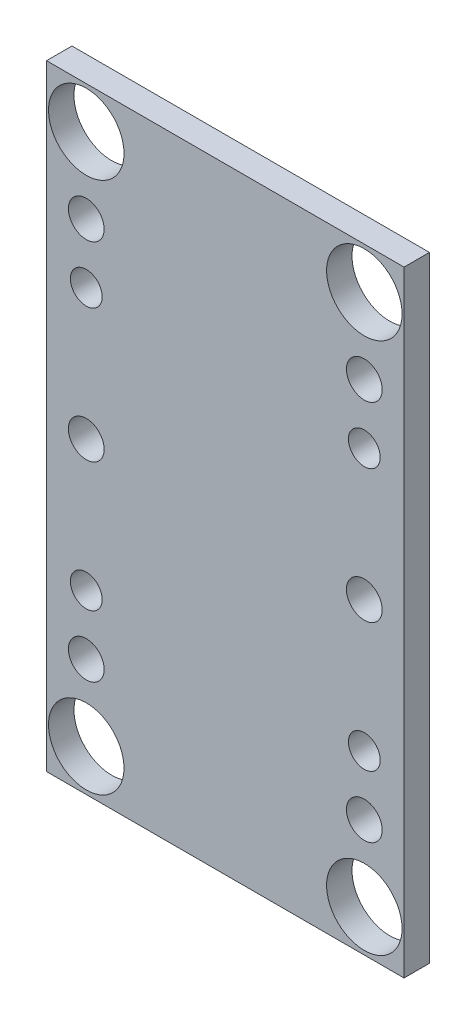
ISO-10303-21;
HEADER;
FILE_DESCRIPTION(('STEP AP214'),'2;1');
FILE_NAME('part.step','',(''),(''),'','','');
FILE_SCHEMA(('AUTOMOTIVE_DESIGN { 1 0 10303 214 1 1 1 1 }'));
ENDSEC;
DATA;
#1=APPLICATION_CONTEXT('core data for automotive mechanical design processes');
#2=APPLICATION_PROTOCOL_DEFINITION('international standard','automotive_design',2000,#1);
#3=PRODUCT_CONTEXT('',#1,'mechanical');
#4=PRODUCT('Part','Part','',(#3));
#5=PRODUCT_RELATED_PRODUCT_CATEGORY('part','',(#4));
#6=PRODUCT_DEFINITION_FORMATION('','',#4);
#7=PRODUCT_DEFINITION_CONTEXT('part definition',#1,'design');
#8=PRODUCT_DEFINITION('design','',#6,#7);
#9=PRODUCT_DEFINITION_SHAPE('','',#8);
#10=(LENGTH_UNIT() NAMED_UNIT(*) SI_UNIT(.MILLI.,.METRE.));
#11=(NAMED_UNIT(*) PLANE_ANGLE_UNIT() SI_UNIT($,.RADIAN.));
#12=(NAMED_UNIT(*) SI_UNIT($,.STERADIAN.) SOLID_ANGLE_UNIT());
#13=UNCERTAINTY_MEASURE_WITH_UNIT(LENGTH_MEASURE(1.E-05),#10,'distance_accuracy_value','');
#14=(GEOMETRIC_REPRESENTATION_CONTEXT(3) GLOBAL_UNCERTAINTY_ASSIGNED_CONTEXT((#13)) GLOBAL_UNIT_ASSIGNED_CONTEXT((#10,
#11,#12)) REPRESENTATION_CONTEXT('',''));
#15=CARTESIAN_POINT('',(0.,0.,0.));
#16=DIRECTION('',(0.,0.,1.));
#17=DIRECTION('',(1.,0.,0.));
#18=AXIS2_PLACEMENT_3D('',#15,#16,#17);
#19=CARTESIAN_POINT('',(-45.,-78.,6.4));
#20=DIRECTION('',(0.,0.,1.));
#21=DIRECTION('',(1.,0.,0.));
#22=AXIS2_PLACEMENT_3D('',#19,#20,#21);
#23=PLANE('',#22);
#24=CARTESIAN_POINT('',(-35.,-67.,6.4));
#25=DIRECTION('',(0.,0.,1.));
#26=DIRECTION('',(1.,0.,0.));
#27=AXIS2_PLACEMENT_3D('',#24,#25,#26);
#28=CIRCLE('',#27,9.5);
#29=CARTESIAN_POINT('',(-25.5,-67.,6.4));
#30=VERTEX_POINT('',#29);
#31=EDGE_CURVE('E122',#30,#30,#28,.T.);
#32=ORIENTED_EDGE('',*,*,#31,.F.);
#33=EDGE_LOOP('',(#32));
#34=FACE_BOUND('',#33,.T.);
#35=CARTESIAN_POINT('',(-35.,0.,6.4));
#36=DIRECTION('',(0.,0.,1.));
#37=DIRECTION('',(1.,0.,0.));
#38=AXIS2_PLACEMENT_3D('',#35,#36,#37);
#39=CIRCLE('',#38,4.5);
#40=CARTESIAN_POINT('',(-30.5,0.,6.4));
#41=VERTEX_POINT('',#40);
#42=EDGE_CURVE('E134',#41,#41,#39,.T.);
#43=ORIENTED_EDGE('',*,*,#42,.F.);
#44=EDGE_LOOP('',(#43));
#45=FACE_BOUND('',#44,.T.);
#46=CARTESIAN_POINT('',(-35.,33.,6.4));
#47=DIRECTION('',(0.,0.,1.));
#48=DIRECTION('',(1.,0.,0.));
#49=AXIS2_PLACEMENT_3D('',#46,#47,#48);
#50=CIRCLE('',#49,4.00375);
#51=CARTESIAN_POINT('',(-30.99625,33.,6.4));
#52=VERTEX_POINT('',#51);
#53=EDGE_CURVE('E146',#52,#52,#50,.T.);
#54=ORIENTED_EDGE('',*,*,#53,.F.);
#55=EDGE_LOOP('',(#54));
#56=FACE_BOUND('',#55,.T.);
#57=CARTESIAN_POINT('',(35.,-67.,6.4));
#58=DIRECTION('',(0.,0.,1.));
#59=DIRECTION('',(1.,0.,0.));
#60=AXIS2_PLACEMENT_3D('',#57,#58,#59);
#61=CIRCLE('',#60,9.5);
#62=CARTESIAN_POINT('',(44.5,-67.,6.4));
#63=VERTEX_POINT('',#62);
#64=EDGE_CURVE('E158',#63,#63,#61,.T.);
#65=ORIENTED_EDGE('',*,*,#64,.F.);
#66=EDGE_LOOP('',(#65));
#67=FACE_BOUND('',#66,.T.);
#68=CARTESIAN_POINT('',(35.,-48.,6.4));
#69=DIRECTION('',(0.,0.,1.));
#70=DIRECTION('',(1.,0.,0.));
#71=AXIS2_PLACEMENT_3D('',#68,#69,#70);
#72=CIRCLE('',#71,4.5);
#73=CARTESIAN_POINT('',(39.5,-48.,6.4));
#74=VERTEX_POINT('',#73);
#75=EDGE_CURVE('E170',#74,#74,#72,.T.);
#76=ORIENTED_EDGE('',*,*,#75,.F.);
#77=EDGE_LOOP('',(#76));
#78=FACE_BOUND('',#77,.T.);
#79=CARTESIAN_POINT('',(35.,48.,6.4));
#80=DIRECTION('',(0.,0.,1.));
#81=DIRECTION('',(1.,0.,0.));
#82=AXIS2_PLACEMENT_3D('',#79,#80,#81);
#83=CIRCLE('',#82,4.5);
#84=CARTESIAN_POINT('',(39.5,48.,6.4));
#85=VERTEX_POINT('',#84);
#86=EDGE_CURVE('E182',#85,#85,#83,.T.);
#87=ORIENTED_EDGE('',*,*,#86,.F.);
#88=EDGE_LOOP('',(#87));
#89=FACE_BOUND('',#88,.T.);
#90=CARTESIAN_POINT('',(35.,33.,6.4));
#91=DIRECTION('',(0.,0.,1.));
#92=DIRECTION('',(1.,0.,0.));
#93=AXIS2_PLACEMENT_3D('',#90,#91,#92);
#94=CIRCLE('',#93,4.00375);
#95=CARTESIAN_POINT('',(39.00375,33.,6.4));
#96=VERTEX_POINT('',#95);
#97=EDGE_CURVE('E91',#96,#96,#94,.T.);
#98=ORIENTED_EDGE('',*,*,#97,.F.);
#99=EDGE_LOOP('',(#98));
#100=FACE_BOUND('',#99,.T.);
#101=CARTESIAN_POINT('',(35.,-33.,6.4));
#102=DIRECTION('',(0.,0.,1.));
#103=DIRECTION('',(1.,0.,0.));
#104=AXIS2_PLACEMENT_3D('',#101,#102,#103);
#105=CIRCLE('',#104,4.00375);
#106=CARTESIAN_POINT('',(39.00375,-33.,6.4));
#107=VERTEX_POINT('',#106);
#108=EDGE_CURVE('E188',#107,#107,#105,.T.);
#109=ORIENTED_EDGE('',*,*,#108,.F.);
#110=EDGE_LOOP('',(#109));
#111=FACE_BOUND('',#110,.T.);
#112=CARTESIAN_POINT('',(35.,0.,6.4));
#113=DIRECTION('',(0.,0.,1.));
#114=DIRECTION('',(1.,0.,0.));
#115=AXIS2_PLACEMENT_3D('',#112,#113,#114);
#116=CIRCLE('',#115,4.5);
#117=CARTESIAN_POINT('',(39.5,0.,6.4));
#118=VERTEX_POINT('',#117);
#119=EDGE_CURVE('E176',#118,#118,#116,.T.);
#120=ORIENTED_EDGE('',*,*,#119,.F.);
#121=EDGE_LOOP('',(#120));
#122=FACE_BOUND('',#121,.T.);
#123=CARTESIAN_POINT('',(35.,67.,6.4));
#124=DIRECTION('',(0.,0.,1.));
#125=DIRECTION('',(1.,0.,0.));
#126=AXIS2_PLACEMENT_3D('',#123,#124,#125);
#127=CIRCLE('',#126,9.5);
#128=CARTESIAN_POINT('',(44.5,67.,6.4));
#129=VERTEX_POINT('',#128);
#130=EDGE_CURVE('E164',#129,#129,#127,.T.);
#131=ORIENTED_EDGE('',*,*,#130,.F.);
#132=EDGE_LOOP('',(#131));
#133=FACE_BOUND('',#132,.T.);
#134=CARTESIAN_POINT('',(-35.,-33.,6.4));
#135=DIRECTION('',(0.,0.,1.));
#136=DIRECTION('',(1.,0.,0.));
#137=AXIS2_PLACEMENT_3D('',#134,#135,#136);
#138=CIRCLE('',#137,4.00375);
#139=CARTESIAN_POINT('',(-30.99625,-33.,6.4));
#140=VERTEX_POINT('',#139);
#141=EDGE_CURVE('E152',#140,#140,#138,.T.);
#142=ORIENTED_EDGE('',*,*,#141,.F.);
#143=EDGE_LOOP('',(#142));
#144=FACE_BOUND('',#143,.T.);
#145=CARTESIAN_POINT('',(-35.,-48.,6.4));
#146=DIRECTION('',(0.,0.,1.));
#147=DIRECTION('',(1.,0.,0.));
#148=AXIS2_PLACEMENT_3D('',#145,#146,#147);
#149=CIRCLE('',#148,4.5);
#150=CARTESIAN_POINT('',(-30.5,-48.,6.4));
#151=VERTEX_POINT('',#150);
#152=EDGE_CURVE('E140',#151,#151,#149,.T.);
#153=ORIENTED_EDGE('',*,*,#152,.F.);
#154=EDGE_LOOP('',(#153));
#155=FACE_BOUND('',#154,.T.);
#156=CARTESIAN_POINT('',(-35.,48.,6.4));
#157=DIRECTION('',(0.,0.,1.));
#158=DIRECTION('',(1.,0.,0.));
#159=AXIS2_PLACEMENT_3D('',#156,#157,#158);
#160=CIRCLE('',#159,4.5);
#161=CARTESIAN_POINT('',(-30.5,48.,6.4));
#162=VERTEX_POINT('',#161);
#163=EDGE_CURVE('E128',#162,#162,#160,.T.);
#164=ORIENTED_EDGE('',*,*,#163,.F.);
#165=EDGE_LOOP('',(#164));
#166=FACE_BOUND('',#165,.T.);
#167=CARTESIAN_POINT('',(-35.,67.,6.4));
#168=DIRECTION('',(0.,0.,1.));
#169=DIRECTION('',(1.,0.,0.));
#170=AXIS2_PLACEMENT_3D('',#167,#168,#169);
#171=CIRCLE('',#170,9.5);
#172=CARTESIAN_POINT('',(-25.5,67.,6.4));
#173=VERTEX_POINT('',#172);
#174=EDGE_CURVE('E116',#173,#173,#171,.T.);
#175=ORIENTED_EDGE('',*,*,#174,.F.);
#176=EDGE_LOOP('',(#175));
#177=FACE_BOUND('',#176,.T.);
#178=DIRECTION('',(0.,-1.,0.));
#179=VECTOR('',#178,1.);
#180=CARTESIAN_POINT('',(-45.,78.,6.4));
#181=LINE('',#180,#179);
#182=CARTESIAN_POINT('',(-45.,77.5,6.4));
#183=VERTEX_POINT('',#182);
#184=CARTESIAN_POINT('',(-45.,-77.5,6.4));
#185=VERTEX_POINT('',#184);
#186=EDGE_CURVE('E87',#183,#185,#181,.T.);
#187=ORIENTED_EDGE('',*,*,#186,.T.);
#188=DIRECTION('',(1.,0.,0.));
#189=VECTOR('',#188,1.);
#190=CARTESIAN_POINT('',(-45.,-77.5,6.4));
#191=LINE('',#190,#189);
#192=CARTESIAN_POINT('',(45.,-77.5,6.4));
#193=VERTEX_POINT('',#192);
#194=EDGE_CURVE('E105',#185,#193,#191,.T.);
#195=ORIENTED_EDGE('',*,*,#194,.T.);
#196=DIRECTION('',(0.,1.,0.));
#197=VECTOR('',#196,1.);
#198=CARTESIAN_POINT('',(45.,-78.,6.4));
#199=LINE('',#198,#197);
#200=CARTESIAN_POINT('',(45.,77.5,6.4));
#201=VERTEX_POINT('',#200);
#202=EDGE_CURVE('E100',#193,#201,#199,.T.);
#203=ORIENTED_EDGE('',*,*,#202,.T.);
#204=DIRECTION('',(-1.,0.,0.));
#205=VECTOR('',#204,1.);
#206=CARTESIAN_POINT('',(-45.,77.5,6.4));
#207=LINE('',#206,#205);
#208=EDGE_CURVE('E48',#201,#183,#207,.T.);
#209=ORIENTED_EDGE('',*,*,#208,.T.);
#210=EDGE_LOOP('',(#187,#195,#203,#209));
#211=FACE_BOUND('',#210,.T.);
#212=ADVANCED_FACE('F33',(#34,#45,#56,#67,#78,#89,#100,#111,#122,#133,#144,#155,#166,#177,#211),
#23,.T.);
#213=CARTESIAN_POINT('',(-45.,-78.,0.));
#214=DIRECTION('',(0.,0.,1.));
#215=DIRECTION('',(1.,0.,0.));
#216=AXIS2_PLACEMENT_3D('',#213,#214,#215);
#217=PLANE('',#216);
#218=CARTESIAN_POINT('',(-35.,-67.,0.));
#219=DIRECTION('',(0.,0.,1.));
#220=DIRECTION('',(1.,0.,0.));
#221=AXIS2_PLACEMENT_3D('',#218,#219,#220);
#222=CIRCLE('',#221,9.5);
#223=CARTESIAN_POINT('',(-25.5,-67.,0.));
#224=VERTEX_POINT('',#223);
#225=EDGE_CURVE('E119',#224,#224,#222,.T.);
#226=ORIENTED_EDGE('',*,*,#225,.T.);
#227=EDGE_LOOP('',(#226));
#228=FACE_BOUND('',#227,.T.);
#229=CARTESIAN_POINT('',(-35.,0.,0.));
#230=DIRECTION('',(0.,0.,1.));
#231=DIRECTION('',(1.,0.,0.));
#232=AXIS2_PLACEMENT_3D('',#229,#230,#231);
#233=CIRCLE('',#232,4.5);
#234=CARTESIAN_POINT('',(-30.5,0.,0.));
#235=VERTEX_POINT('',#234);
#236=EDGE_CURVE('E131',#235,#235,#233,.T.);
#237=ORIENTED_EDGE('',*,*,#236,.T.);
#238=EDGE_LOOP('',(#237));
#239=FACE_BOUND('',#238,.T.);
#240=CARTESIAN_POINT('',(-35.,33.,0.));
#241=DIRECTION('',(0.,0.,1.));
#242=DIRECTION('',(1.,0.,0.));
#243=AXIS2_PLACEMENT_3D('',#240,#241,#242);
#244=CIRCLE('',#243,4.00375);
#245=CARTESIAN_POINT('',(-30.99625,33.,0.));
#246=VERTEX_POINT('',#245);
#247=EDGE_CURVE('E143',#246,#246,#244,.T.);
#248=ORIENTED_EDGE('',*,*,#247,.T.);
#249=EDGE_LOOP('',(#248));
#250=FACE_BOUND('',#249,.T.);
#251=CARTESIAN_POINT('',(35.,-67.,0.));
#252=DIRECTION('',(0.,0.,1.));
#253=DIRECTION('',(1.,0.,0.));
#254=AXIS2_PLACEMENT_3D('',#251,#252,#253);
#255=CIRCLE('',#254,9.5);
#256=CARTESIAN_POINT('',(44.5,-67.,0.));
#257=VERTEX_POINT('',#256);
#258=EDGE_CURVE('E155',#257,#257,#255,.T.);
#259=ORIENTED_EDGE('',*,*,#258,.T.);
#260=EDGE_LOOP('',(#259));
#261=FACE_BOUND('',#260,.T.);
#262=CARTESIAN_POINT('',(35.,-48.,0.));
#263=DIRECTION('',(0.,0.,1.));
#264=DIRECTION('',(1.,0.,0.));
#265=AXIS2_PLACEMENT_3D('',#262,#263,#264);
#266=CIRCLE('',#265,4.5);
#267=CARTESIAN_POINT('',(39.5,-48.,0.));
#268=VERTEX_POINT('',#267);
#269=EDGE_CURVE('E167',#268,#268,#266,.T.);
#270=ORIENTED_EDGE('',*,*,#269,.T.);
#271=EDGE_LOOP('',(#270));
#272=FACE_BOUND('',#271,.T.);
#273=CARTESIAN_POINT('',(35.,48.,0.));
#274=DIRECTION('',(0.,0.,1.));
#275=DIRECTION('',(1.,0.,0.));
#276=AXIS2_PLACEMENT_3D('',#273,#274,#275);
#277=CIRCLE('',#276,4.5);
#278=CARTESIAN_POINT('',(39.5,48.,0.));
#279=VERTEX_POINT('',#278);
#280=EDGE_CURVE('E179',#279,#279,#277,.T.);
#281=ORIENTED_EDGE('',*,*,#280,.T.);
#282=EDGE_LOOP('',(#281));
#283=FACE_BOUND('',#282,.T.);
#284=CARTESIAN_POINT('',(35.,33.,0.));
#285=DIRECTION('',(0.,0.,1.));
#286=DIRECTION('',(1.,0.,0.));
#287=AXIS2_PLACEMENT_3D('',#284,#285,#286);
#288=CIRCLE('',#287,4.00375);
#289=CARTESIAN_POINT('',(39.00375,33.,0.));
#290=VERTEX_POINT('',#289);
#291=EDGE_CURVE('E95',#290,#290,#288,.T.);
#292=ORIENTED_EDGE('',*,*,#291,.T.);
#293=EDGE_LOOP('',(#292));
#294=FACE_BOUND('',#293,.T.);
#295=CARTESIAN_POINT('',(35.,-33.,0.));
#296=DIRECTION('',(0.,0.,1.));
#297=DIRECTION('',(1.,0.,0.));
#298=AXIS2_PLACEMENT_3D('',#295,#296,#297);
#299=CIRCLE('',#298,4.00375);
#300=CARTESIAN_POINT('',(39.00375,-33.,0.));
#301=VERTEX_POINT('',#300);
#302=EDGE_CURVE('E185',#301,#301,#299,.T.);
#303=ORIENTED_EDGE('',*,*,#302,.T.);
#304=EDGE_LOOP('',(#303));
#305=FACE_BOUND('',#304,.T.);
#306=CARTESIAN_POINT('',(35.,0.,0.));
#307=DIRECTION('',(0.,0.,1.));
#308=DIRECTION('',(1.,0.,0.));
#309=AXIS2_PLACEMENT_3D('',#306,#307,#308);
#310=CIRCLE('',#309,4.5);
#311=CARTESIAN_POINT('',(39.5,0.,0.));
#312=VERTEX_POINT('',#311);
#313=EDGE_CURVE('E173',#312,#312,#310,.T.);
#314=ORIENTED_EDGE('',*,*,#313,.T.);
#315=EDGE_LOOP('',(#314));
#316=FACE_BOUND('',#315,.T.);
#317=CARTESIAN_POINT('',(35.,67.,0.));
#318=DIRECTION('',(0.,0.,1.));
#319=DIRECTION('',(1.,0.,0.));
#320=AXIS2_PLACEMENT_3D('',#317,#318,#319);
#321=CIRCLE('',#320,9.5);
#322=CARTESIAN_POINT('',(44.5,67.,0.));
#323=VERTEX_POINT('',#322);
#324=EDGE_CURVE('E161',#323,#323,#321,.T.);
#325=ORIENTED_EDGE('',*,*,#324,.T.);
#326=EDGE_LOOP('',(#325));
#327=FACE_BOUND('',#326,.T.);
#328=CARTESIAN_POINT('',(-35.,-33.,0.));
#329=DIRECTION('',(0.,0.,1.));
#330=DIRECTION('',(1.,0.,0.));
#331=AXIS2_PLACEMENT_3D('',#328,#329,#330);
#332=CIRCLE('',#331,4.00375);
#333=CARTESIAN_POINT('',(-30.99625,-33.,0.));
#334=VERTEX_POINT('',#333);
#335=EDGE_CURVE('E149',#334,#334,#332,.T.);
#336=ORIENTED_EDGE('',*,*,#335,.T.);
#337=EDGE_LOOP('',(#336));
#338=FACE_BOUND('',#337,.T.);
#339=CARTESIAN_POINT('',(-35.,-48.,0.));
#340=DIRECTION('',(0.,0.,1.));
#341=DIRECTION('',(1.,0.,0.));
#342=AXIS2_PLACEMENT_3D('',#339,#340,#341);
#343=CIRCLE('',#342,4.5);
#344=CARTESIAN_POINT('',(-30.5,-48.,0.));
#345=VERTEX_POINT('',#344);
#346=EDGE_CURVE('E137',#345,#345,#343,.T.);
#347=ORIENTED_EDGE('',*,*,#346,.T.);
#348=EDGE_LOOP('',(#347));
#349=FACE_BOUND('',#348,.T.);
#350=CARTESIAN_POINT('',(-35.,48.,0.));
#351=DIRECTION('',(0.,0.,1.));
#352=DIRECTION('',(1.,0.,0.));
#353=AXIS2_PLACEMENT_3D('',#350,#351,#352);
#354=CIRCLE('',#353,4.5);
#355=CARTESIAN_POINT('',(-30.5,48.,0.));
#356=VERTEX_POINT('',#355);
#357=EDGE_CURVE('E125',#356,#356,#354,.T.);
#358=ORIENTED_EDGE('',*,*,#357,.T.);
#359=EDGE_LOOP('',(#358));
#360=FACE_BOUND('',#359,.T.);
#361=CARTESIAN_POINT('',(-35.,67.,0.));
#362=DIRECTION('',(0.,0.,1.));
#363=DIRECTION('',(1.,0.,0.));
#364=AXIS2_PLACEMENT_3D('',#361,#362,#363);
#365=CIRCLE('',#364,9.5);
#366=CARTESIAN_POINT('',(-25.5,67.,0.));
#367=VERTEX_POINT('',#366);
#368=EDGE_CURVE('E109',#367,#367,#365,.T.);
#369=ORIENTED_EDGE('',*,*,#368,.T.);
#370=EDGE_LOOP('',(#369));
#371=FACE_BOUND('',#370,.T.);
#372=DIRECTION('',(-1.,0.,0.));
#373=VECTOR('',#372,1.);
#374=CARTESIAN_POINT('',(-45.,-77.5,0.));
#375=LINE('',#374,#373);
#376=CARTESIAN_POINT('',(45.,-77.5,0.));
#377=VERTEX_POINT('',#376);
#378=CARTESIAN_POINT('',(-45.,-77.5,0.));
#379=VERTEX_POINT('',#378);
#380=EDGE_CURVE('E55',#377,#379,#375,.T.);
#381=ORIENTED_EDGE('',*,*,#380,.T.);
#382=DIRECTION('',(0.,-1.,0.));
#383=VECTOR('',#382,1.);
#384=CARTESIAN_POINT('',(-45.,78.,0.));
#385=LINE('',#384,#383);
#386=CARTESIAN_POINT('',(-45.,77.5,0.));
#387=VERTEX_POINT('',#386);
#388=EDGE_CURVE('E85',#387,#379,#385,.T.);
#389=ORIENTED_EDGE('',*,*,#388,.F.);
#390=DIRECTION('',(1.,0.,0.));
#391=VECTOR('',#390,1.);
#392=CARTESIAN_POINT('',(-45.,77.5,0.));
#393=LINE('',#392,#391);
#394=CARTESIAN_POINT('',(45.,77.5,0.));
#395=VERTEX_POINT('',#394);
#396=EDGE_CURVE('E71',#387,#395,#393,.T.);
#397=ORIENTED_EDGE('',*,*,#396,.T.);
#398=DIRECTION('',(0.,1.,0.));
#399=VECTOR('',#398,1.);
#400=CARTESIAN_POINT('',(45.,-78.,0.));
#401=LINE('',#400,#399);
#402=EDGE_CURVE('E90',#377,#395,#401,.T.);
#403=ORIENTED_EDGE('',*,*,#402,.F.);
#404=EDGE_LOOP('',(#381,#389,#397,#403));
#405=FACE_BOUND('',#404,.T.);
#406=ADVANCED_FACE('F89',(#228,#239,#250,#261,#272,#283,#294,#305,#316,#327,#338,#349,#360,#371,
#405),#217,.F.);
#407=CARTESIAN_POINT('',(-45.,78.,6.4));
#408=DIRECTION('',(1.,0.,0.));
#409=DIRECTION('',(0.,1.,0.));
#410=AXIS2_PLACEMENT_3D('',#407,#408,#409);
#411=PLANE('',#410);
#412=DIRECTION('',(0.,0.,-1.));
#413=VECTOR('',#412,1.);
#414=CARTESIAN_POINT('',(-45.,-77.5,10.));
#415=LINE('',#414,#413);
#416=EDGE_CURVE('E79',#185,#379,#415,.T.);
#417=ORIENTED_EDGE('',*,*,#416,.F.);
#418=ORIENTED_EDGE('',*,*,#186,.F.);
#419=DIRECTION('',(0.,0.,-1.));
#420=VECTOR('',#419,1.);
#421=CARTESIAN_POINT('',(-45.,77.5,10.));
#422=LINE('',#421,#420);
#423=EDGE_CURVE('E74',#183,#387,#422,.T.);
#424=ORIENTED_EDGE('',*,*,#423,.T.);
#425=ORIENTED_EDGE('',*,*,#388,.T.);
#426=EDGE_LOOP('',(#417,#418,#424,#425));
#427=FACE_BOUND('',#426,.T.);
#428=ADVANCED_FACE('F35',(#427),#411,.F.);
#429=CARTESIAN_POINT('',(45.,-78.,6.4));
#430=DIRECTION('',(-1.,0.,0.));
#431=DIRECTION('',(0.,-1.,0.));
#432=AXIS2_PLACEMENT_3D('',#429,#430,#431);
#433=PLANE('',#432);
#434=DIRECTION('',(0.,0.,1.));
#435=VECTOR('',#434,1.);
#436=CARTESIAN_POINT('',(45.,-77.5,6.4));
#437=LINE('',#436,#435);
#438=EDGE_CURVE('E12',#377,#193,#437,.T.);
#439=ORIENTED_EDGE('',*,*,#438,.F.);
#440=ORIENTED_EDGE('',*,*,#402,.T.);
#441=DIRECTION('',(0.,0.,-1.));
#442=VECTOR('',#441,1.);
#443=CARTESIAN_POINT('',(45.,77.5,6.4));
#444=LINE('',#443,#442);
#445=EDGE_CURVE('E41',#201,#395,#444,.T.);
#446=ORIENTED_EDGE('',*,*,#445,.F.);
#447=ORIENTED_EDGE('',*,*,#202,.F.);
#448=EDGE_LOOP('',(#439,#440,#446,#447));
#449=FACE_BOUND('',#448,.T.);
#450=ADVANCED_FACE('F107',(#449),#433,.F.);
#451=CARTESIAN_POINT('',(35.,33.,6.4));
#452=DIRECTION('',(0.,0.,-1.));
#453=DIRECTION('',(-1.,0.,0.));
#454=AXIS2_PLACEMENT_3D('',#451,#452,#453);
#455=CYLINDRICAL_SURFACE('',#454,4.00375);
#456=ORIENTED_EDGE('',*,*,#97,.T.);
#457=EDGE_LOOP('',(#456));
#458=FACE_BOUND('',#457,.T.);
#459=ORIENTED_EDGE('',*,*,#291,.F.);
#460=EDGE_LOOP('',(#459));
#461=FACE_BOUND('',#460,.T.);
#462=ADVANCED_FACE('F195',(#458,#461),#455,.F.);
#463=CARTESIAN_POINT('',(35.,-33.,6.4));
#464=DIRECTION('',(0.,0.,-1.));
#465=DIRECTION('',(-1.,0.,0.));
#466=AXIS2_PLACEMENT_3D('',#463,#464,#465);
#467=CYLINDRICAL_SURFACE('',#466,4.00375);
#468=ORIENTED_EDGE('',*,*,#108,.T.);
#469=EDGE_LOOP('',(#468));
#470=FACE_BOUND('',#469,.T.);
#471=ORIENTED_EDGE('',*,*,#302,.F.);
#472=EDGE_LOOP('',(#471));
#473=FACE_BOUND('',#472,.T.);
#474=ADVANCED_FACE('F197',(#470,#473),#467,.F.);
#475=CARTESIAN_POINT('',(35.,48.,6.4));
#476=DIRECTION('',(0.,0.,-1.));
#477=DIRECTION('',(-1.,0.,0.));
#478=AXIS2_PLACEMENT_3D('',#475,#476,#477);
#479=CYLINDRICAL_SURFACE('',#478,4.5);
#480=ORIENTED_EDGE('',*,*,#86,.T.);
#481=EDGE_LOOP('',(#480));
#482=FACE_BOUND('',#481,.T.);
#483=ORIENTED_EDGE('',*,*,#280,.F.);
#484=EDGE_LOOP('',(#483));
#485=FACE_BOUND('',#484,.T.);
#486=ADVANCED_FACE('F204',(#482,#485),#479,.F.);
#487=CARTESIAN_POINT('',(35.,0.,6.4));
#488=DIRECTION('',(0.,0.,-1.));
#489=DIRECTION('',(-1.,0.,0.));
#490=AXIS2_PLACEMENT_3D('',#487,#488,#489);
#491=CYLINDRICAL_SURFACE('',#490,4.5);
#492=ORIENTED_EDGE('',*,*,#119,.T.);
#493=EDGE_LOOP('',(#492));
#494=FACE_BOUND('',#493,.T.);
#495=ORIENTED_EDGE('',*,*,#313,.F.);
#496=EDGE_LOOP('',(#495));
#497=FACE_BOUND('',#496,.T.);
#498=ADVANCED_FACE('F290',(#494,#497),#491,.F.);
#499=CARTESIAN_POINT('',(35.,-48.,6.4));
#500=DIRECTION('',(0.,0.,-1.));
#501=DIRECTION('',(-1.,0.,0.));
#502=AXIS2_PLACEMENT_3D('',#499,#500,#501);
#503=CYLINDRICAL_SURFACE('',#502,4.5);
#504=ORIENTED_EDGE('',*,*,#75,.T.);
#505=EDGE_LOOP('',(#504));
#506=FACE_BOUND('',#505,.T.);
#507=ORIENTED_EDGE('',*,*,#269,.F.);
#508=EDGE_LOOP('',(#507));
#509=FACE_BOUND('',#508,.T.);
#510=ADVANCED_FACE('F286',(#506,#509),#503,.F.);
#511=CARTESIAN_POINT('',(35.,67.,6.4));
#512=DIRECTION('',(0.,0.,-1.));
#513=DIRECTION('',(-1.,0.,0.));
#514=AXIS2_PLACEMENT_3D('',#511,#512,#513);
#515=CYLINDRICAL_SURFACE('',#514,9.5);
#516=ORIENTED_EDGE('',*,*,#130,.T.);
#517=EDGE_LOOP('',(#516));
#518=FACE_BOUND('',#517,.T.);
#519=ORIENTED_EDGE('',*,*,#324,.F.);
#520=EDGE_LOOP('',(#519));
#521=FACE_BOUND('',#520,.T.);
#522=ADVANCED_FACE('F282',(#518,#521),#515,.F.);
#523=CARTESIAN_POINT('',(35.,-67.,6.4));
#524=DIRECTION('',(0.,0.,-1.));
#525=DIRECTION('',(-1.,0.,0.));
#526=AXIS2_PLACEMENT_3D('',#523,#524,#525);
#527=CYLINDRICAL_SURFACE('',#526,9.5);
#528=ORIENTED_EDGE('',*,*,#64,.T.);
#529=EDGE_LOOP('',(#528));
#530=FACE_BOUND('',#529,.T.);
#531=ORIENTED_EDGE('',*,*,#258,.F.);
#532=EDGE_LOOP('',(#531));
#533=FACE_BOUND('',#532,.T.);
#534=ADVANCED_FACE('F278',(#530,#533),#527,.F.);
#535=CARTESIAN_POINT('',(-35.,-33.,6.4));
#536=DIRECTION('',(0.,0.,-1.));
#537=DIRECTION('',(-1.,0.,0.));
#538=AXIS2_PLACEMENT_3D('',#535,#536,#537);
#539=CYLINDRICAL_SURFACE('',#538,4.00375);
#540=ORIENTED_EDGE('',*,*,#141,.T.);
#541=EDGE_LOOP('',(#540));
#542=FACE_BOUND('',#541,.T.);
#543=ORIENTED_EDGE('',*,*,#335,.F.);
#544=EDGE_LOOP('',(#543));
#545=FACE_BOUND('',#544,.T.);
#546=ADVANCED_FACE('F274',(#542,#545),#539,.F.);
#547=CARTESIAN_POINT('',(-35.,33.,6.4));
#548=DIRECTION('',(0.,0.,-1.));
#549=DIRECTION('',(-1.,0.,0.));
#550=AXIS2_PLACEMENT_3D('',#547,#548,#549);
#551=CYLINDRICAL_SURFACE('',#550,4.00375);
#552=ORIENTED_EDGE('',*,*,#53,.T.);
#553=EDGE_LOOP('',(#552));
#554=FACE_BOUND('',#553,.T.);
#555=ORIENTED_EDGE('',*,*,#247,.F.);
#556=EDGE_LOOP('',(#555));
#557=FACE_BOUND('',#556,.T.);
#558=ADVANCED_FACE('F270',(#554,#557),#551,.F.);
#559=CARTESIAN_POINT('',(-35.,-48.,6.4));
#560=DIRECTION('',(0.,0.,-1.));
#561=DIRECTION('',(-1.,0.,0.));
#562=AXIS2_PLACEMENT_3D('',#559,#560,#561);
#563=CYLINDRICAL_SURFACE('',#562,4.5);
#564=ORIENTED_EDGE('',*,*,#152,.T.);
#565=EDGE_LOOP('',(#564));
#566=FACE_BOUND('',#565,.T.);
#567=ORIENTED_EDGE('',*,*,#346,.F.);
#568=EDGE_LOOP('',(#567));
#569=FACE_BOUND('',#568,.T.);
#570=ADVANCED_FACE('F266',(#566,#569),#563,.F.);
#571=CARTESIAN_POINT('',(-35.,0.,6.4));
#572=DIRECTION('',(0.,0.,-1.));
#573=DIRECTION('',(-1.,0.,0.));
#574=AXIS2_PLACEMENT_3D('',#571,#572,#573);
#575=CYLINDRICAL_SURFACE('',#574,4.5);
#576=ORIENTED_EDGE('',*,*,#42,.T.);
#577=EDGE_LOOP('',(#576));
#578=FACE_BOUND('',#577,.T.);
#579=ORIENTED_EDGE('',*,*,#236,.F.);
#580=EDGE_LOOP('',(#579));
#581=FACE_BOUND('',#580,.T.);
#582=ADVANCED_FACE('F262',(#578,#581),#575,.F.);
#583=CARTESIAN_POINT('',(-35.,48.,6.4));
#584=DIRECTION('',(0.,0.,-1.));
#585=DIRECTION('',(-1.,0.,0.));
#586=AXIS2_PLACEMENT_3D('',#583,#584,#585);
#587=CYLINDRICAL_SURFACE('',#586,4.5);
#588=ORIENTED_EDGE('',*,*,#163,.T.);
#589=EDGE_LOOP('',(#588));
#590=FACE_BOUND('',#589,.T.);
#591=ORIENTED_EDGE('',*,*,#357,.F.);
#592=EDGE_LOOP('',(#591));
#593=FACE_BOUND('',#592,.T.);
#594=ADVANCED_FACE('F255',(#590,#593),#587,.F.);
#595=CARTESIAN_POINT('',(-35.,-67.,6.4));
#596=DIRECTION('',(0.,0.,-1.));
#597=DIRECTION('',(-1.,0.,0.));
#598=AXIS2_PLACEMENT_3D('',#595,#596,#597);
#599=CYLINDRICAL_SURFACE('',#598,9.5);
#600=ORIENTED_EDGE('',*,*,#31,.T.);
#601=EDGE_LOOP('',(#600));
#602=FACE_BOUND('',#601,.T.);
#603=ORIENTED_EDGE('',*,*,#225,.F.);
#604=EDGE_LOOP('',(#603));
#605=FACE_BOUND('',#604,.T.);
#606=ADVANCED_FACE('F246',(#602,#605),#599,.F.);
#607=CARTESIAN_POINT('',(-35.,67.,6.4));
#608=DIRECTION('',(0.,0.,-1.));
#609=DIRECTION('',(-1.,0.,0.));
#610=AXIS2_PLACEMENT_3D('',#607,#608,#609);
#611=CYLINDRICAL_SURFACE('',#610,9.5);
#612=ORIENTED_EDGE('',*,*,#174,.T.);
#613=EDGE_LOOP('',(#612));
#614=FACE_BOUND('',#613,.T.);
#615=ORIENTED_EDGE('',*,*,#368,.F.);
#616=EDGE_LOOP('',(#615));
#617=FACE_BOUND('',#616,.T.);
#618=ADVANCED_FACE('F243',(#614,#617),#611,.F.);
#619=CARTESIAN_POINT('',(-45.,77.5,10.));
#620=DIRECTION('',(0.,1.,0.));
#621=DIRECTION('',(-1.,0.,0.));
#622=AXIS2_PLACEMENT_3D('',#619,#620,#621);
#623=PLANE('',#622);
#624=ORIENTED_EDGE('',*,*,#445,.T.);
#625=ORIENTED_EDGE('',*,*,#396,.F.);
#626=ORIENTED_EDGE('',*,*,#423,.F.);
#627=ORIENTED_EDGE('',*,*,#208,.F.);
#628=EDGE_LOOP('',(#624,#625,#626,#627));
#629=FACE_BOUND('',#628,.T.);
#630=ADVANCED_FACE('F73',(#629),#623,.T.);
#631=CARTESIAN_POINT('',(-45.,-77.5,10.));
#632=DIRECTION('',(0.,-1.,0.));
#633=DIRECTION('',(1.,0.,0.));
#634=AXIS2_PLACEMENT_3D('',#631,#632,#633);
#635=PLANE('',#634);
#636=ORIENTED_EDGE('',*,*,#416,.T.);
#637=ORIENTED_EDGE('',*,*,#380,.F.);
#638=ORIENTED_EDGE('',*,*,#438,.T.);
#639=ORIENTED_EDGE('',*,*,#194,.F.);
#640=EDGE_LOOP('',(#636,#637,#638,#639));
#641=FACE_BOUND('',#640,.T.);
#642=ADVANCED_FACE('F108',(#641),#635,.T.);
#643=CLOSED_SHELL('',(#212,#406,#428,#450,#462,#474,#486,#498,#510,#522,#534,#546,#558,#570,
#582,#594,#606,#618,#630,#642));
#644=MANIFOLD_SOLID_BREP('B2',#643);
#645=ADVANCED_BREP_SHAPE_REPRESENTATION('',(#18,#644),#14);
#646=SHAPE_DEFINITION_REPRESENTATION(#9,#645);
ENDSEC;
END-ISO-10303-21;
